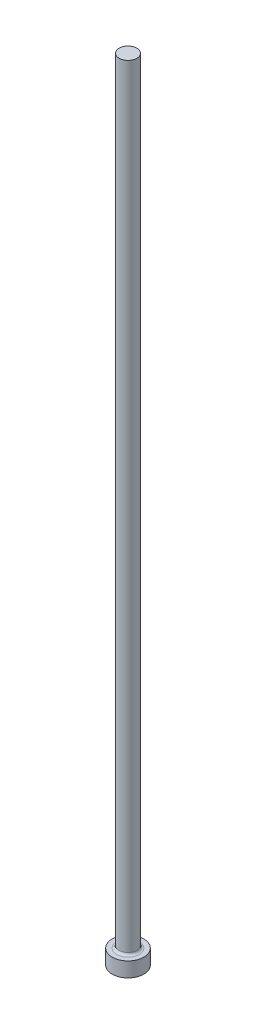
from build123d import *


with BuildPart() as part:
    # Sketch1 → Revolve1 (revolve)
    with BuildSketch(Plane.XY, mode=Mode.PRIVATE) as revolve1_sk:
        with BuildLine():
            Line((0, 0), (5.08, 0))
            Line((5.08, 0), (5.08, 4.7498))
            Line((5.08, 4.7498), (3.60299, 4.7498))
            ThreePointArc((3.60299, 4.7498), (3.064174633, 4.972984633), (2.84099, 5.5118))
            Line((2.84099, 5.5118), (2.84099, 254))
            Line((2.84099, 254), (0, 254))
            Line((0, 254), (0, 0))
        make_face()
    revolve(revolve1_sk.sketch.rotate(Axis((0, 254, 0), (0, -1, 0)), 180), axis=Axis((0, 254, 0), (0, -1, 0)))


solid = part.part
